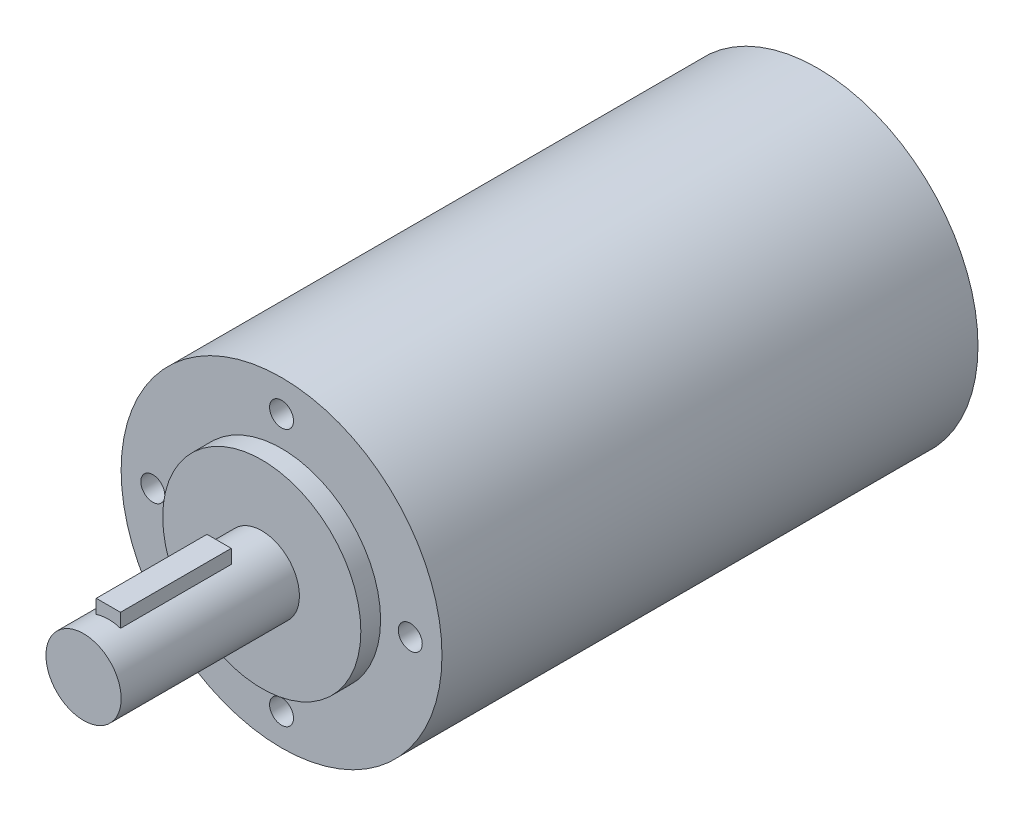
from build123d import *

# Parameters (mm, degrees)
SKETCH1_R          = 40.8305
EXTRUDE1_DEPTH     = 136.4234
SKETCH2_R          = 18.161
CUT_EXTRUDE1_DEPTH = 4.7498
SKETCH3_R          = 25.2095
EXTRUDE2_DEPTH     = 5.0292
SKETCH4_R          = 9.5758
EXTRUDE3_DEPTH     = 45.3644
SKETCH5_R          = 3.048
CUT_EXTRUDE2_DEPTH = 15.24
CIRPATTERN1_COUNT  = 4
SKETCH6_W          = 6.1722
SKETCH6_H          = 28.194
EXTRUDE4_DEPTH     = 5.588


with BuildPart() as part:
    # Sketch1 → Extrude1 (new body)
    with BuildSketch(Plane.XY):
        Circle(SKETCH1_R)
    extrude(amount=EXTRUDE1_DEPTH)

    # Sketch2 → Cut-Extrude1 (cut)
    with BuildSketch(Plane(origin=(0, 0, 0), x_dir=(-1, 0, 0), z_dir=(0, 0, -1))):
        Circle(SKETCH2_R)
    extrude(amount=-CUT_EXTRUDE1_DEPTH, mode=Mode.SUBTRACT)

    # Sketch3 → Extrude2 (add)
    with BuildSketch(Plane.XY.offset(136.4234)):
        Circle(SKETCH3_R)
    extrude(amount=EXTRUDE2_DEPTH)

    # Sketch4 → Extrude3 (add)
    with BuildSketch(Plane.XY.offset(141.4526)):
        Circle(SKETCH4_R)
    extrude(amount=EXTRUDE3_DEPTH)

    # Sketch5 → Cut-Extrude2 (cut)
    with BuildSketch(Plane.XY.offset(136.4234)):
        with Locations((0, 32.766)):
            Circle(SKETCH5_R)
    cut_extrude2 = extrude(amount=-CUT_EXTRUDE2_DEPTH, mode=Mode.SUBTRACT)

    # CirPattern1: Cut-Extrude2 ×4 about axis
    cirpattern1_axis = Axis((0, 0, 0), (0, 0, 1))
    for i in range(1, CIRPATTERN1_COUNT):
        add(cut_extrude2.rotate(cirpattern1_axis, i * 360 / CIRPATTERN1_COUNT), mode=Mode.SUBTRACT)

    # Sketch6 → Extrude4 (add)
    with BuildSketch(Plane(origin=(0, 7.0358, 0), x_dir=(-1, 0, 0), z_dir=(0, 1, 0))):
        with Locations((0.0381, 166.37)):
            Rectangle(SKETCH6_W, SKETCH6_H)
    extrude(amount=EXTRUDE4_DEPTH)


solid = part.part
